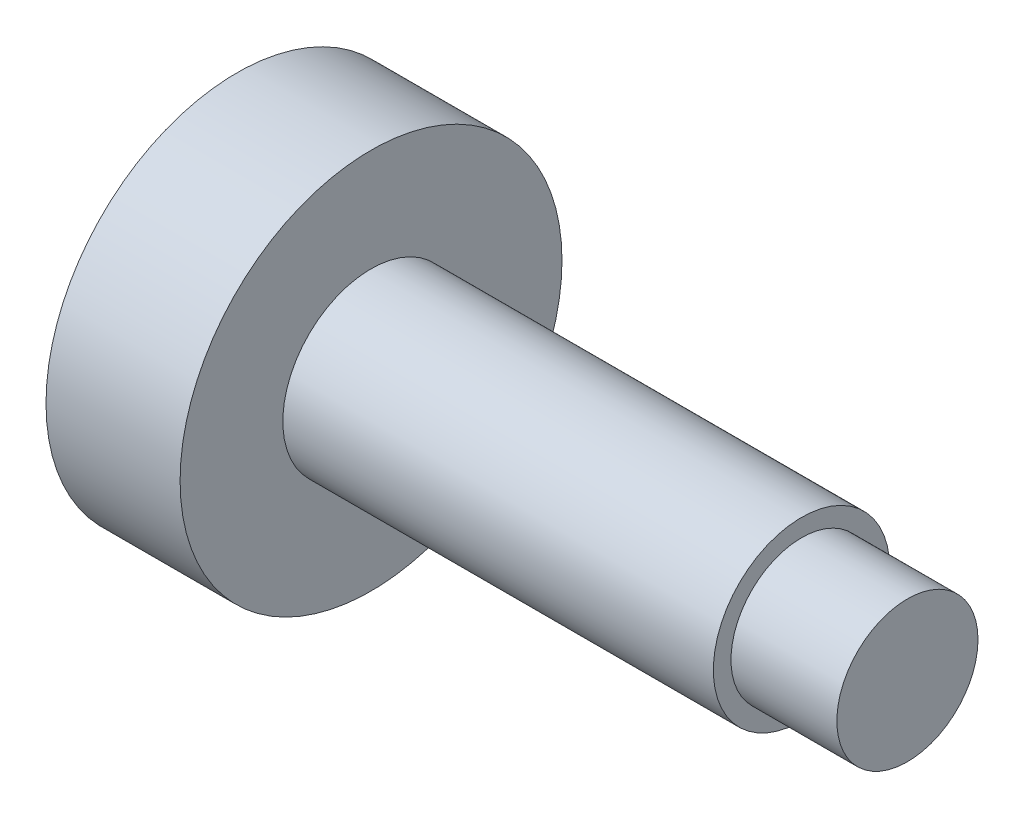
from build123d import *

# Parameters (mm, degrees)
ENL_V_MAT_EXTRU_1_DEPTH = 3


with BuildPart() as part:
    # Esquisse1 → R_volution1 (revolve)
    with BuildSketch(Plane.XY, mode=Mode.PRIVATE) as r_volution1_sk:
        Polygon((60, 0), (0, 0), (-35, 0), (-35, 27.055), (-16, 27.055), (-16, 12.5), (45, 12.5), (45, 10), (60, 10), align=None)
    revolve(r_volution1_sk.sketch.rotate(Axis((0, 0, 0), (-1, 0, 0)), 90), axis=Axis((0, 0, 0), (-1, 0, 0)))

    # Esquisse2 → Enl_v. mat.-Extru.1 (cut)
    with BuildSketch(Plane.ZY.offset(35)):
        with BuildLine():
            Line((-1, 23), (1, 23))
            ThreePointArc((1, 23), (2.414213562, 22.414213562), (3, 21))
            Line((3, 21), (3, 5))
            ThreePointArc((3, 5), (2.414213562, 3.585786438), (1, 3))
            Line((1, 3), (-1, 3))
            ThreePointArc((-1, 3), (-2.414213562, 3.585786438), (-3, 5))
            Line((-3, 5), (-3, 21))
            ThreePointArc((-3, 21), (-2.414213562, 22.414213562), (-1, 23))
        make_face()
    extrude(amount=-ENL_V_MAT_EXTRU_1_DEPTH, mode=Mode.SUBTRACT)


solid = part.part
